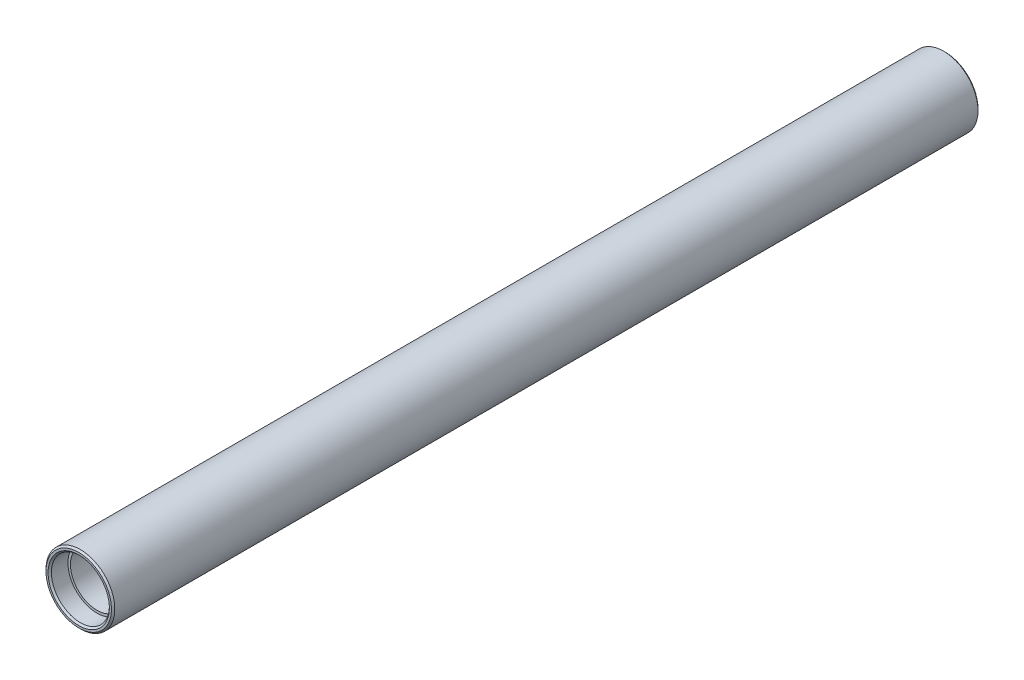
from build123d import *

# Parameters (mm, degrees)
ESQUISSE1_R                  = 20.75
ESQUISSE1_R_2                = 16
EXTRUSION1_DEPTH             = 261.5
ESQUISSE2_R                  = 17.5
ENL_V_MAT_EXTRU_1_DEPTH      = 11
CHANFREIN1_SIZE              = 1
CHANFREIN1_OF_SYM_TRIE1_SIZE = 1


with BuildPart() as part:
    # Esquisse1 → Extrusion1 (new body)
    with BuildSketch(Plane.XY):
        Circle(ESQUISSE1_R)
        Circle(ESQUISSE1_R_2, mode=Mode.SUBTRACT)
    extrusion1 = extrude(amount=EXTRUSION1_DEPTH)

    # Esquisse2 → Enl_v. mat.-Extru.1 (cut)
    with BuildSketch(Plane(origin=(0, 0, 0), x_dir=(-1, 0, 0), z_dir=(0, 0, -1))):
        Circle(ESQUISSE2_R)
    enl_v_mat_extru_1 = extrude(amount=-ENL_V_MAT_EXTRU_1_DEPTH, mode=Mode.SUBTRACT)

    # Chanfrein1
    chanfrein1_edges = [part.edges().sort_by_distance(p)[0] for p in [
        (17.5, 0, 0),
        (-20.75, 0, 0),
    ]]
    chamfer(chanfrein1_edges, length=CHANFREIN1_SIZE)

    # Sym_trie1: Extrusion1, Enl_v. mat.-Extru.1 across plane
    add(extrusion1.mirror(Plane.XY.offset(261.5)))
    add(enl_v_mat_extru_1.mirror(Plane.XY.offset(261.5)), mode=Mode.SUBTRACT)

    # Chanfrein1 of Sym_trie1
    chanfrein1_of_sym_trie1_edges = [part.edges().sort_by_distance(p)[0] for p in [
        (17.5, 0, 523),
        (-20.75, 0, 523),
    ]]
    chamfer(chanfrein1_of_sym_trie1_edges, length=CHANFREIN1_OF_SYM_TRIE1_SIZE)


solid = part.part
